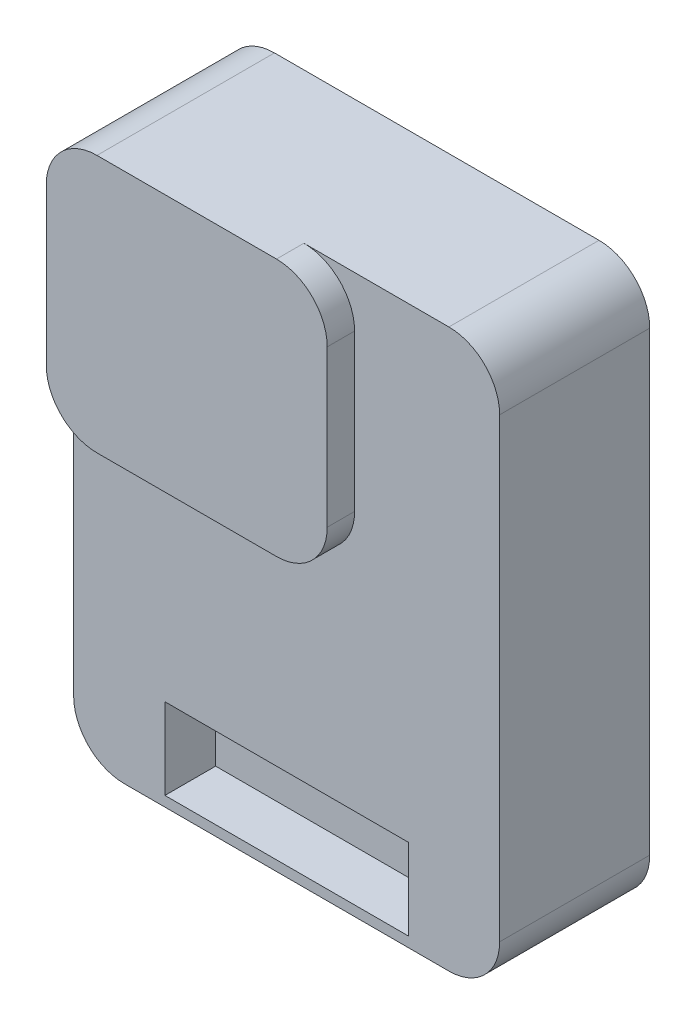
ISO-10303-21;
HEADER;
FILE_DESCRIPTION(('STEP AP214'),'2;1');
FILE_NAME('part.step','',(''),(''),'','','');
FILE_SCHEMA(('AUTOMOTIVE_DESIGN { 1 0 10303 214 1 1 1 1 }'));
ENDSEC;
DATA;
#1=APPLICATION_CONTEXT('core data for automotive mechanical design processes');
#2=APPLICATION_PROTOCOL_DEFINITION('international standard','automotive_design',2000,#1);
#3=PRODUCT_CONTEXT('',#1,'mechanical');
#4=PRODUCT('Part','Part','',(#3));
#5=PRODUCT_RELATED_PRODUCT_CATEGORY('part','',(#4));
#6=PRODUCT_DEFINITION_FORMATION('','',#4);
#7=PRODUCT_DEFINITION_CONTEXT('part definition',#1,'design');
#8=PRODUCT_DEFINITION('design','',#6,#7);
#9=PRODUCT_DEFINITION_SHAPE('','',#8);
#10=(LENGTH_UNIT() NAMED_UNIT(*) SI_UNIT(.MILLI.,.METRE.));
#11=(NAMED_UNIT(*) PLANE_ANGLE_UNIT() SI_UNIT($,.RADIAN.));
#12=(NAMED_UNIT(*) SI_UNIT($,.STERADIAN.) SOLID_ANGLE_UNIT());
#13=UNCERTAINTY_MEASURE_WITH_UNIT(LENGTH_MEASURE(1.E-05),#10,'distance_accuracy_value','');
#14=(GEOMETRIC_REPRESENTATION_CONTEXT(3) GLOBAL_UNCERTAINTY_ASSIGNED_CONTEXT((#13)) GLOBAL_UNIT_ASSIGNED_CONTEXT((#10,
#11,#12)) REPRESENTATION_CONTEXT('',''));
#15=CARTESIAN_POINT('',(0.,0.,0.));
#16=DIRECTION('',(0.,0.,1.));
#17=DIRECTION('',(1.,0.,0.));
#18=AXIS2_PLACEMENT_3D('',#15,#16,#17);
#19=CARTESIAN_POINT('',(0.,0.,14.8));
#20=DIRECTION('',(0.,0.,1.));
#21=DIRECTION('',(1.,0.,0.));
#22=AXIS2_PLACEMENT_3D('',#19,#20,#21);
#23=PLANE('',#22);
#24=DIRECTION('',(0.,1.,0.));
#25=VECTOR('',#24,1.);
#26=CARTESIAN_POINT('',(12.,-18.5,14.8));
#27=LINE('',#26,#25);
#28=CARTESIAN_POINT('',(12.,-26.5,14.8));
#29=VERTEX_POINT('',#28);
#30=CARTESIAN_POINT('',(12.,-18.5,14.8));
#31=VERTEX_POINT('',#30);
#32=EDGE_CURVE('E51',#29,#31,#27,.T.);
#33=ORIENTED_EDGE('',*,*,#32,.F.);
#34=DIRECTION('',(1.,0.,0.));
#35=VECTOR('',#34,1.);
#36=CARTESIAN_POINT('',(-12.,-26.5,14.8));
#37=LINE('',#36,#35);
#38=CARTESIAN_POINT('',(-12.,-26.5,14.8));
#39=VERTEX_POINT('',#38);
#40=EDGE_CURVE('E182',#39,#29,#37,.T.);
#41=ORIENTED_EDGE('',*,*,#40,.F.);
#42=DIRECTION('',(0.,-1.,0.));
#43=VECTOR('',#42,1.);
#44=CARTESIAN_POINT('',(-12.,-18.5,14.8));
#45=LINE('',#44,#43);
#46=CARTESIAN_POINT('',(-12.,-18.5,14.8));
#47=VERTEX_POINT('',#46);
#48=EDGE_CURVE('E185',#47,#39,#45,.T.);
#49=ORIENTED_EDGE('',*,*,#48,.F.);
#50=DIRECTION('',(-1.,0.,0.));
#51=VECTOR('',#50,1.);
#52=CARTESIAN_POINT('',(-12.,-18.5,14.8));
#53=LINE('',#52,#51);
#54=EDGE_CURVE('E191',#31,#47,#53,.T.);
#55=ORIENTED_EDGE('',*,*,#54,.F.);
#56=EDGE_LOOP('',(#33,#41,#49,#55));
#57=FACE_BOUND('',#56,.T.);
#58=DIRECTION('',(0.,1.,0.));
#59=VECTOR('',#58,1.);
#60=CARTESIAN_POINT('',(21.,27.5,14.8));
#61=LINE('',#60,#59);
#62=CARTESIAN_POINT('',(21.,-22.5,14.8));
#63=VERTEX_POINT('',#62);
#64=CARTESIAN_POINT('',(21.,22.5,14.8));
#65=VERTEX_POINT('',#64);
#66=EDGE_CURVE('E219',#63,#65,#61,.T.);
#67=ORIENTED_EDGE('',*,*,#66,.T.);
#68=CARTESIAN_POINT('',(16.,22.5,14.8));
#69=DIRECTION('',(0.,0.,1.));
#70=DIRECTION('',(1.,0.,0.));
#71=AXIS2_PLACEMENT_3D('',#68,#69,#70);
#72=CIRCLE('',#71,5.);
#73=CARTESIAN_POINT('',(16.,27.5,14.8));
#74=VERTEX_POINT('',#73);
#75=EDGE_CURVE('E289',#65,#74,#72,.T.);
#76=ORIENTED_EDGE('',*,*,#75,.T.);
#77=DIRECTION('',(-1.,0.,0.));
#78=VECTOR('',#77,1.);
#79=CARTESIAN_POINT('',(-21.,27.5,14.8));
#80=LINE('',#79,#78);
#81=CARTESIAN_POINT('',(1.69999999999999,27.5,14.8));
#82=VERTEX_POINT('',#81);
#83=EDGE_CURVE('E222',#74,#82,#80,.T.);
#84=ORIENTED_EDGE('',*,*,#83,.T.);
#85=CARTESIAN_POINT('',(1.69999999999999,22.5,14.8));
#86=DIRECTION('',(0.,0.,1.));
#87=DIRECTION('',(1.,0.,0.));
#88=AXIS2_PLACEMENT_3D('',#85,#86,#87);
#89=CIRCLE('',#88,5.);
#90=CARTESIAN_POINT('',(6.69999999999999,22.5,14.8));
#91=VERTEX_POINT('',#90);
#92=EDGE_CURVE('E11',#82,#91,#89,.F.);
#93=ORIENTED_EDGE('',*,*,#92,.T.);
#94=DIRECTION('',(0.,-1.,0.));
#95=VECTOR('',#94,1.);
#96=CARTESIAN_POINT('',(6.7,0.,14.8));
#97=LINE('',#96,#95);
#98=CARTESIAN_POINT('',(6.7,7.10000000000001,14.8));
#99=VERTEX_POINT('',#98);
#100=EDGE_CURVE('E212',#91,#99,#97,.T.);
#101=ORIENTED_EDGE('',*,*,#100,.T.);
#102=CARTESIAN_POINT('',(1.7,7.10000000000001,14.8));
#103=DIRECTION('',(0.,0.,1.));
#104=DIRECTION('',(1.,0.,0.));
#105=AXIS2_PLACEMENT_3D('',#102,#103,#104);
#106=CIRCLE('',#105,5.);
#107=CARTESIAN_POINT('',(1.7,2.1,14.8));
#108=VERTEX_POINT('',#107);
#109=EDGE_CURVE('E44',#99,#108,#106,.F.);
#110=ORIENTED_EDGE('',*,*,#109,.T.);
#111=DIRECTION('',(-1.,0.,0.));
#112=VECTOR('',#111,1.);
#113=CARTESIAN_POINT('',(0.,2.1,14.8));
#114=LINE('',#113,#112);
#115=CARTESIAN_POINT('',(-16.,2.1,14.8));
#116=VERTEX_POINT('',#115);
#117=EDGE_CURVE('E215',#108,#116,#114,.T.);
#118=ORIENTED_EDGE('',*,*,#117,.T.);
#119=CARTESIAN_POINT('',(-16.,7.1,14.8));
#120=DIRECTION('',(0.,0.,1.));
#121=DIRECTION('',(1.,0.,0.));
#122=AXIS2_PLACEMENT_3D('',#119,#120,#121);
#123=CIRCLE('',#122,5.);
#124=CARTESIAN_POINT('',(-21.,7.1,14.8));
#125=VERTEX_POINT('',#124);
#126=EDGE_CURVE('E295',#116,#125,#123,.F.);
#127=ORIENTED_EDGE('',*,*,#126,.T.);
#128=DIRECTION('',(0.,-1.,0.));
#129=VECTOR('',#128,1.);
#130=CARTESIAN_POINT('',(-21.,27.5,14.8));
#131=LINE('',#130,#129);
#132=CARTESIAN_POINT('',(-21.,-22.5,14.8));
#133=VERTEX_POINT('',#132);
#134=EDGE_CURVE('E225',#125,#133,#131,.T.);
#135=ORIENTED_EDGE('',*,*,#134,.T.);
#136=CARTESIAN_POINT('',(-16.,-22.5,14.8));
#137=DIRECTION('',(0.,0.,1.));
#138=DIRECTION('',(1.,0.,0.));
#139=AXIS2_PLACEMENT_3D('',#136,#137,#138);
#140=CIRCLE('',#139,5.);
#141=CARTESIAN_POINT('',(-16.,-27.5,14.8));
#142=VERTEX_POINT('',#141);
#143=EDGE_CURVE('E285',#133,#142,#140,.T.);
#144=ORIENTED_EDGE('',*,*,#143,.T.);
#145=DIRECTION('',(1.,0.,0.));
#146=VECTOR('',#145,1.);
#147=CARTESIAN_POINT('',(-21.,-27.5,14.8));
#148=LINE('',#147,#146);
#149=CARTESIAN_POINT('',(16.,-27.5,14.8));
#150=VERTEX_POINT('',#149);
#151=EDGE_CURVE('E228',#142,#150,#148,.T.);
#152=ORIENTED_EDGE('',*,*,#151,.T.);
#153=CARTESIAN_POINT('',(16.,-22.5,14.8));
#154=DIRECTION('',(0.,0.,1.));
#155=DIRECTION('',(1.,0.,0.));
#156=AXIS2_PLACEMENT_3D('',#153,#154,#155);
#157=CIRCLE('',#156,5.);
#158=EDGE_CURVE('E287',#150,#63,#157,.T.);
#159=ORIENTED_EDGE('',*,*,#158,.T.);
#160=EDGE_LOOP('',(#67,#76,#84,#93,#101,#110,#118,#127,#135,#144,#152,#159));
#161=FACE_BOUND('',#160,.T.);
#162=ADVANCED_FACE('F36',(#57,#161),#23,.T.);
#163=CARTESIAN_POINT('',(21.,27.5,14.8));
#164=DIRECTION('',(-1.,0.,0.));
#165=DIRECTION('',(0.,-1.,0.));
#166=AXIS2_PLACEMENT_3D('',#163,#164,#165);
#167=PLANE('',#166);
#168=DIRECTION('',(0.,1.,0.));
#169=VECTOR('',#168,1.);
#170=CARTESIAN_POINT('',(21.,27.5,0.));
#171=LINE('',#170,#169);
#172=CARTESIAN_POINT('',(21.,-22.5,0.));
#173=VERTEX_POINT('',#172);
#174=CARTESIAN_POINT('',(21.,22.5,0.));
#175=VERTEX_POINT('',#174);
#176=EDGE_CURVE('E218',#173,#175,#171,.T.);
#177=ORIENTED_EDGE('',*,*,#176,.T.);
#178=DIRECTION('',(0.,0.,-1.));
#179=VECTOR('',#178,1.);
#180=CARTESIAN_POINT('',(21.,22.5,14.8));
#181=LINE('',#180,#179);
#182=EDGE_CURVE('E283',#175,#65,#181,.F.);
#183=ORIENTED_EDGE('',*,*,#182,.T.);
#184=ORIENTED_EDGE('',*,*,#66,.F.);
#185=DIRECTION('',(0.,0.,-1.));
#186=VECTOR('',#185,1.);
#187=CARTESIAN_POINT('',(21.,-22.5,14.8));
#188=LINE('',#187,#186);
#189=EDGE_CURVE('E280',#63,#173,#188,.T.);
#190=ORIENTED_EDGE('',*,*,#189,.T.);
#191=EDGE_LOOP('',(#177,#183,#184,#190));
#192=FACE_BOUND('',#191,.T.);
#193=ADVANCED_FACE('F353',(#192),#167,.F.);
#194=CARTESIAN_POINT('',(-21.,27.5,14.8));
#195=DIRECTION('',(0.,-1.,0.));
#196=DIRECTION('',(0.,0.,-1.));
#197=AXIS2_PLACEMENT_3D('',#194,#195,#196);
#198=PLANE('',#197);
#199=DIRECTION('',(-1.,0.,0.));
#200=VECTOR('',#199,1.);
#201=CARTESIAN_POINT('',(-21.,27.5,17.5));
#202=LINE('',#201,#200);
#203=CARTESIAN_POINT('',(1.69999999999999,27.5,17.5));
#204=VERTEX_POINT('',#203);
#205=CARTESIAN_POINT('',(-16.,27.5,17.5));
#206=VERTEX_POINT('',#205);
#207=EDGE_CURVE('E209',#204,#206,#202,.T.);
#208=ORIENTED_EDGE('',*,*,#207,.F.);
#209=DIRECTION('',(0.,0.,-1.));
#210=VECTOR('',#209,1.);
#211=CARTESIAN_POINT('',(1.69999999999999,27.5,14.8));
#212=LINE('',#211,#210);
#213=EDGE_CURVE('E269',#204,#82,#212,.T.);
#214=ORIENTED_EDGE('',*,*,#213,.T.);
#215=ORIENTED_EDGE('',*,*,#83,.F.);
#216=DIRECTION('',(0.,0.,-1.));
#217=VECTOR('',#216,1.);
#218=CARTESIAN_POINT('',(16.,27.5,14.8));
#219=LINE('',#218,#217);
#220=CARTESIAN_POINT('',(16.,27.5,0.));
#221=VERTEX_POINT('',#220);
#222=EDGE_CURVE('E266',#74,#221,#219,.T.);
#223=ORIENTED_EDGE('',*,*,#222,.T.);
#224=DIRECTION('',(-1.,0.,0.));
#225=VECTOR('',#224,1.);
#226=CARTESIAN_POINT('',(-21.,27.5,0.));
#227=LINE('',#226,#225);
#228=CARTESIAN_POINT('',(-16.,27.5,0.));
#229=VERTEX_POINT('',#228);
#230=EDGE_CURVE('E233',#221,#229,#227,.T.);
#231=ORIENTED_EDGE('',*,*,#230,.T.);
#232=DIRECTION('',(0.,0.,-1.));
#233=VECTOR('',#232,1.);
#234=CARTESIAN_POINT('',(-16.,27.5,14.8));
#235=LINE('',#234,#233);
#236=EDGE_CURVE('E264',#229,#206,#235,.F.);
#237=ORIENTED_EDGE('',*,*,#236,.T.);
#238=EDGE_LOOP('',(#208,#214,#215,#223,#231,#237));
#239=FACE_BOUND('',#238,.T.);
#240=ADVANCED_FACE('F323',(#239),#198,.F.);
#241=CARTESIAN_POINT('',(-21.,27.5,14.8));
#242=DIRECTION('',(1.,0.,0.));
#243=DIRECTION('',(0.,1.,0.));
#244=AXIS2_PLACEMENT_3D('',#241,#242,#243);
#245=PLANE('',#244);
#246=ORIENTED_EDGE('',*,*,#134,.F.);
#247=DIRECTION('',(0.,0.,-1.));
#248=VECTOR('',#247,1.);
#249=CARTESIAN_POINT('',(-21.,7.1,14.8));
#250=LINE('',#249,#248);
#251=CARTESIAN_POINT('',(-21.,7.1,17.5));
#252=VERTEX_POINT('',#251);
#253=EDGE_CURVE('E249',#125,#252,#250,.F.);
#254=ORIENTED_EDGE('',*,*,#253,.T.);
#255=DIRECTION('',(0.,-1.,0.));
#256=VECTOR('',#255,1.);
#257=CARTESIAN_POINT('',(-21.,27.5,17.5));
#258=LINE('',#257,#256);
#259=CARTESIAN_POINT('',(-21.,22.5,17.5));
#260=VERTEX_POINT('',#259);
#261=EDGE_CURVE('E197',#260,#252,#258,.T.);
#262=ORIENTED_EDGE('',*,*,#261,.F.);
#263=DIRECTION('',(0.,0.,-1.));
#264=VECTOR('',#263,1.);
#265=CARTESIAN_POINT('',(-21.,22.5,14.8));
#266=LINE('',#265,#264);
#267=CARTESIAN_POINT('',(-21.,22.5,0.));
#268=VERTEX_POINT('',#267);
#269=EDGE_CURVE('E244',#260,#268,#266,.T.);
#270=ORIENTED_EDGE('',*,*,#269,.T.);
#271=DIRECTION('',(0.,-1.,0.));
#272=VECTOR('',#271,1.);
#273=CARTESIAN_POINT('',(-21.,27.5,0.));
#274=LINE('',#273,#272);
#275=CARTESIAN_POINT('',(-21.,-22.5,0.));
#276=VERTEX_POINT('',#275);
#277=EDGE_CURVE('E236',#268,#276,#274,.T.);
#278=ORIENTED_EDGE('',*,*,#277,.T.);
#279=DIRECTION('',(0.,0.,-1.));
#280=VECTOR('',#279,1.);
#281=CARTESIAN_POINT('',(-21.,-22.5,14.8));
#282=LINE('',#281,#280);
#283=EDGE_CURVE('E247',#276,#133,#282,.F.);
#284=ORIENTED_EDGE('',*,*,#283,.T.);
#285=EDGE_LOOP('',(#246,#254,#262,#270,#278,#284));
#286=FACE_BOUND('',#285,.T.);
#287=ADVANCED_FACE('F332',(#286),#245,.F.);
#288=CARTESIAN_POINT('',(-21.,-27.5,14.8));
#289=DIRECTION('',(0.,1.,0.));
#290=DIRECTION('',(0.,0.,1.));
#291=AXIS2_PLACEMENT_3D('',#288,#289,#290);
#292=PLANE('',#291);
#293=DIRECTION('',(1.,0.,0.));
#294=VECTOR('',#293,1.);
#295=CARTESIAN_POINT('',(-21.,-27.5,0.));
#296=LINE('',#295,#294);
#297=CARTESIAN_POINT('',(-16.,-27.5,0.));
#298=VERTEX_POINT('',#297);
#299=CARTESIAN_POINT('',(16.,-27.5,0.));
#300=VERTEX_POINT('',#299);
#301=EDGE_CURVE('E223',#298,#300,#296,.T.);
#302=ORIENTED_EDGE('',*,*,#301,.T.);
#303=DIRECTION('',(0.,0.,-1.));
#304=VECTOR('',#303,1.);
#305=CARTESIAN_POINT('',(16.,-27.5,14.8));
#306=LINE('',#305,#304);
#307=EDGE_CURVE('E59',#300,#150,#306,.F.);
#308=ORIENTED_EDGE('',*,*,#307,.T.);
#309=ORIENTED_EDGE('',*,*,#151,.F.);
#310=DIRECTION('',(0.,0.,-1.));
#311=VECTOR('',#310,1.);
#312=CARTESIAN_POINT('',(-16.,-27.5,14.8));
#313=LINE('',#312,#311);
#314=EDGE_CURVE('E291',#142,#298,#313,.T.);
#315=ORIENTED_EDGE('',*,*,#314,.T.);
#316=EDGE_LOOP('',(#302,#308,#309,#315));
#317=FACE_BOUND('',#316,.T.);
#318=ADVANCED_FACE('F343',(#317),#292,.F.);
#319=CARTESIAN_POINT('',(0.,0.,0.));
#320=DIRECTION('',(0.,0.,1.));
#321=DIRECTION('',(1.,0.,0.));
#322=AXIS2_PLACEMENT_3D('',#319,#320,#321);
#323=PLANE('',#322);
#324=ORIENTED_EDGE('',*,*,#230,.F.);
#325=CARTESIAN_POINT('',(16.,22.5,0.));
#326=DIRECTION('',(0.,0.,1.));
#327=DIRECTION('',(1.,0.,0.));
#328=AXIS2_PLACEMENT_3D('',#325,#326,#327);
#329=CIRCLE('',#328,5.);
#330=EDGE_CURVE('E278',#221,#175,#329,.F.);
#331=ORIENTED_EDGE('',*,*,#330,.T.);
#332=ORIENTED_EDGE('',*,*,#176,.F.);
#333=CARTESIAN_POINT('',(16.,-22.5,0.));
#334=DIRECTION('',(0.,0.,1.));
#335=DIRECTION('',(1.,0.,0.));
#336=AXIS2_PLACEMENT_3D('',#333,#334,#335);
#337=CIRCLE('',#336,5.);
#338=EDGE_CURVE('E276',#173,#300,#337,.F.);
#339=ORIENTED_EDGE('',*,*,#338,.T.);
#340=ORIENTED_EDGE('',*,*,#301,.F.);
#341=CARTESIAN_POINT('',(-16.,-22.5,0.));
#342=DIRECTION('',(0.,0.,1.));
#343=DIRECTION('',(1.,0.,0.));
#344=AXIS2_PLACEMENT_3D('',#341,#342,#343);
#345=CIRCLE('',#344,5.);
#346=EDGE_CURVE('E274',#298,#276,#345,.F.);
#347=ORIENTED_EDGE('',*,*,#346,.T.);
#348=ORIENTED_EDGE('',*,*,#277,.F.);
#349=CARTESIAN_POINT('',(-16.,22.5,0.));
#350=DIRECTION('',(0.,0.,1.));
#351=DIRECTION('',(1.,0.,0.));
#352=AXIS2_PLACEMENT_3D('',#349,#350,#351);
#353=CIRCLE('',#352,5.);
#354=EDGE_CURVE('E272',#268,#229,#353,.F.);
#355=ORIENTED_EDGE('',*,*,#354,.T.);
#356=EDGE_LOOP('',(#324,#331,#332,#339,#340,#347,#348,#355));
#357=FACE_BOUND('',#356,.T.);
#358=ADVANCED_FACE('F345',(#357),#323,.F.);
#359=CARTESIAN_POINT('',(-21.,2.1,17.5));
#360=DIRECTION('',(0.,1.,0.));
#361=DIRECTION('',(0.,0.,1.));
#362=AXIS2_PLACEMENT_3D('',#359,#360,#361);
#363=PLANE('',#362);
#364=DIRECTION('',(1.,0.,0.));
#365=VECTOR('',#364,1.);
#366=CARTESIAN_POINT('',(-21.,2.1,17.5));
#367=LINE('',#366,#365);
#368=CARTESIAN_POINT('',(-16.,2.1,17.5));
#369=VERTEX_POINT('',#368);
#370=CARTESIAN_POINT('',(1.69999999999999,2.1,17.5));
#371=VERTEX_POINT('',#370);
#372=EDGE_CURVE('E203',#369,#371,#367,.T.);
#373=ORIENTED_EDGE('',*,*,#372,.F.);
#374=DIRECTION('',(0.,0.,-1.));
#375=VECTOR('',#374,1.);
#376=CARTESIAN_POINT('',(-16.,2.1,17.5));
#377=LINE('',#376,#375);
#378=EDGE_CURVE('E241',#369,#116,#377,.T.);
#379=ORIENTED_EDGE('',*,*,#378,.T.);
#380=ORIENTED_EDGE('',*,*,#117,.F.);
#381=DIRECTION('',(0.,0.,-1.));
#382=VECTOR('',#381,1.);
#383=CARTESIAN_POINT('',(1.7,2.1,17.5));
#384=LINE('',#383,#382);
#385=EDGE_CURVE('E230',#108,#371,#384,.F.);
#386=ORIENTED_EDGE('',*,*,#385,.T.);
#387=EDGE_LOOP('',(#373,#379,#380,#386));
#388=FACE_BOUND('',#387,.T.);
#389=ADVANCED_FACE('F305',(#388),#363,.F.);
#390=CARTESIAN_POINT('',(6.69999999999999,27.5,17.5));
#391=DIRECTION('',(-1.,0.,0.));
#392=DIRECTION('',(0.,-1.,0.));
#393=AXIS2_PLACEMENT_3D('',#390,#391,#392);
#394=PLANE('',#393);
#395=DIRECTION('',(0.,1.,0.));
#396=VECTOR('',#395,1.);
#397=CARTESIAN_POINT('',(6.69999999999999,27.5,17.5));
#398=LINE('',#397,#396);
#399=CARTESIAN_POINT('',(6.7,7.10000000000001,17.5));
#400=VERTEX_POINT('',#399);
#401=CARTESIAN_POINT('',(6.69999999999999,22.5,17.5));
#402=VERTEX_POINT('',#401);
#403=EDGE_CURVE('E206',#400,#402,#398,.T.);
#404=ORIENTED_EDGE('',*,*,#403,.F.);
#405=DIRECTION('',(0.,0.,-1.));
#406=VECTOR('',#405,1.);
#407=CARTESIAN_POINT('',(6.7,7.10000000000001,17.5));
#408=LINE('',#407,#406);
#409=EDGE_CURVE('E261',#400,#99,#408,.T.);
#410=ORIENTED_EDGE('',*,*,#409,.T.);
#411=ORIENTED_EDGE('',*,*,#100,.F.);
#412=DIRECTION('',(0.,0.,-1.));
#413=VECTOR('',#412,1.);
#414=CARTESIAN_POINT('',(6.69999999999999,22.5,17.5));
#415=LINE('',#414,#413);
#416=EDGE_CURVE('E259',#91,#402,#415,.F.);
#417=ORIENTED_EDGE('',*,*,#416,.T.);
#418=EDGE_LOOP('',(#404,#410,#411,#417));
#419=FACE_BOUND('',#418,.T.);
#420=ADVANCED_FACE('F314',(#419),#394,.F.);
#421=CARTESIAN_POINT('',(0.,0.,17.5));
#422=DIRECTION('',(0.,0.,1.));
#423=DIRECTION('',(1.,0.,0.));
#424=AXIS2_PLACEMENT_3D('',#421,#422,#423);
#425=PLANE('',#424);
#426=ORIENTED_EDGE('',*,*,#261,.T.);
#427=CARTESIAN_POINT('',(-16.,7.1,17.5));
#428=DIRECTION('',(0.,0.,1.));
#429=DIRECTION('',(1.,0.,0.));
#430=AXIS2_PLACEMENT_3D('',#427,#428,#429);
#431=CIRCLE('',#430,5.);
#432=EDGE_CURVE('E257',#252,#369,#431,.T.);
#433=ORIENTED_EDGE('',*,*,#432,.T.);
#434=ORIENTED_EDGE('',*,*,#372,.T.);
#435=CARTESIAN_POINT('',(1.7,7.10000000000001,17.5));
#436=DIRECTION('',(0.,0.,1.));
#437=DIRECTION('',(1.,0.,0.));
#438=AXIS2_PLACEMENT_3D('',#435,#436,#437);
#439=CIRCLE('',#438,5.);
#440=EDGE_CURVE('E255',#371,#400,#439,.T.);
#441=ORIENTED_EDGE('',*,*,#440,.T.);
#442=ORIENTED_EDGE('',*,*,#403,.T.);
#443=CARTESIAN_POINT('',(1.69999999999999,22.5,17.5));
#444=DIRECTION('',(0.,0.,1.));
#445=DIRECTION('',(1.,0.,0.));
#446=AXIS2_PLACEMENT_3D('',#443,#444,#445);
#447=CIRCLE('',#446,5.);
#448=EDGE_CURVE('E253',#402,#204,#447,.T.);
#449=ORIENTED_EDGE('',*,*,#448,.T.);
#450=ORIENTED_EDGE('',*,*,#207,.T.);
#451=CARTESIAN_POINT('',(-16.,22.5,17.5));
#452=DIRECTION('',(0.,0.,1.));
#453=DIRECTION('',(1.,0.,0.));
#454=AXIS2_PLACEMENT_3D('',#451,#452,#453);
#455=CIRCLE('',#454,5.);
#456=EDGE_CURVE('E251',#206,#260,#455,.T.);
#457=ORIENTED_EDGE('',*,*,#456,.T.);
#458=EDGE_LOOP('',(#426,#433,#434,#441,#442,#449,#450,#457));
#459=FACE_BOUND('',#458,.T.);
#460=ADVANCED_FACE('F311',(#459),#425,.T.);
#461=CARTESIAN_POINT('',(-16.,7.1,17.5));
#462=DIRECTION('',(0.,0.,-1.));
#463=DIRECTION('',(-1.,0.,0.));
#464=AXIS2_PLACEMENT_3D('',#461,#462,#463);
#465=CYLINDRICAL_SURFACE('',#464,5.);
#466=ORIENTED_EDGE('',*,*,#432,.F.);
#467=ORIENTED_EDGE('',*,*,#253,.F.);
#468=ORIENTED_EDGE('',*,*,#126,.F.);
#469=ORIENTED_EDGE('',*,*,#378,.F.);
#470=EDGE_LOOP('',(#466,#467,#468,#469));
#471=FACE_BOUND('',#470,.T.);
#472=ADVANCED_FACE('F336',(#471),#465,.T.);
#473=CARTESIAN_POINT('',(1.7,7.10000000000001,17.5));
#474=DIRECTION('',(0.,0.,-1.));
#475=DIRECTION('',(-1.,0.,0.));
#476=AXIS2_PLACEMENT_3D('',#473,#474,#475);
#477=CYLINDRICAL_SURFACE('',#476,5.);
#478=ORIENTED_EDGE('',*,*,#440,.F.);
#479=ORIENTED_EDGE('',*,*,#385,.F.);
#480=ORIENTED_EDGE('',*,*,#109,.F.);
#481=ORIENTED_EDGE('',*,*,#409,.F.);
#482=EDGE_LOOP('',(#478,#479,#480,#481));
#483=FACE_BOUND('',#482,.T.);
#484=ADVANCED_FACE('F308',(#483),#477,.T.);
#485=CARTESIAN_POINT('',(1.69999999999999,22.5,14.8));
#486=DIRECTION('',(0.,0.,-1.));
#487=DIRECTION('',(-1.,0.,0.));
#488=AXIS2_PLACEMENT_3D('',#485,#486,#487);
#489=CYLINDRICAL_SURFACE('',#488,5.);
#490=ORIENTED_EDGE('',*,*,#448,.F.);
#491=ORIENTED_EDGE('',*,*,#416,.F.);
#492=ORIENTED_EDGE('',*,*,#92,.F.);
#493=ORIENTED_EDGE('',*,*,#213,.F.);
#494=EDGE_LOOP('',(#490,#491,#492,#493));
#495=FACE_BOUND('',#494,.T.);
#496=ADVANCED_FACE('F318',(#495),#489,.T.);
#497=CARTESIAN_POINT('',(16.,22.5,14.8));
#498=DIRECTION('',(0.,0.,-1.));
#499=DIRECTION('',(-1.,0.,0.));
#500=AXIS2_PLACEMENT_3D('',#497,#498,#499);
#501=CYLINDRICAL_SURFACE('',#500,5.);
#502=ORIENTED_EDGE('',*,*,#75,.F.);
#503=ORIENTED_EDGE('',*,*,#182,.F.);
#504=ORIENTED_EDGE('',*,*,#330,.F.);
#505=ORIENTED_EDGE('',*,*,#222,.F.);
#506=EDGE_LOOP('',(#502,#503,#504,#505));
#507=FACE_BOUND('',#506,.T.);
#508=ADVANCED_FACE('F358',(#507),#501,.T.);
#509=CARTESIAN_POINT('',(16.,-22.5,14.8));
#510=DIRECTION('',(0.,0.,-1.));
#511=DIRECTION('',(-1.,0.,0.));
#512=AXIS2_PLACEMENT_3D('',#509,#510,#511);
#513=CYLINDRICAL_SURFACE('',#512,5.);
#514=ORIENTED_EDGE('',*,*,#158,.F.);
#515=ORIENTED_EDGE('',*,*,#307,.F.);
#516=ORIENTED_EDGE('',*,*,#338,.F.);
#517=ORIENTED_EDGE('',*,*,#189,.F.);
#518=EDGE_LOOP('',(#514,#515,#516,#517));
#519=FACE_BOUND('',#518,.T.);
#520=ADVANCED_FACE('F350',(#519),#513,.T.);
#521=CARTESIAN_POINT('',(-16.,-22.5,14.8));
#522=DIRECTION('',(0.,0.,-1.));
#523=DIRECTION('',(-1.,0.,0.));
#524=AXIS2_PLACEMENT_3D('',#521,#522,#523);
#525=CYLINDRICAL_SURFACE('',#524,5.);
#526=ORIENTED_EDGE('',*,*,#143,.F.);
#527=ORIENTED_EDGE('',*,*,#283,.F.);
#528=ORIENTED_EDGE('',*,*,#346,.F.);
#529=ORIENTED_EDGE('',*,*,#314,.F.);
#530=EDGE_LOOP('',(#526,#527,#528,#529));
#531=FACE_BOUND('',#530,.T.);
#532=ADVANCED_FACE('F341',(#531),#525,.T.);
#533=CARTESIAN_POINT('',(-16.,22.5,14.8));
#534=DIRECTION('',(0.,0.,-1.));
#535=DIRECTION('',(-1.,0.,0.));
#536=AXIS2_PLACEMENT_3D('',#533,#534,#535);
#537=CYLINDRICAL_SURFACE('',#536,5.);
#538=ORIENTED_EDGE('',*,*,#456,.F.);
#539=ORIENTED_EDGE('',*,*,#236,.F.);
#540=ORIENTED_EDGE('',*,*,#354,.F.);
#541=ORIENTED_EDGE('',*,*,#269,.F.);
#542=EDGE_LOOP('',(#538,#539,#540,#541));
#543=FACE_BOUND('',#542,.T.);
#544=ADVANCED_FACE('F38',(#543),#537,.T.);
#545=CARTESIAN_POINT('',(12.,-18.5,9.8));
#546=DIRECTION('',(1.,0.,0.));
#547=DIRECTION('',(0.,0.,-1.));
#548=AXIS2_PLACEMENT_3D('',#545,#546,#547);
#549=PLANE('',#548);
#550=ORIENTED_EDGE('',*,*,#32,.T.);
#551=DIRECTION('',(0.,0.,1.));
#552=VECTOR('',#551,1.);
#553=CARTESIAN_POINT('',(12.,-18.5,9.8));
#554=LINE('',#553,#552);
#555=CARTESIAN_POINT('',(12.,-18.5,9.8));
#556=VERTEX_POINT('',#555);
#557=EDGE_CURVE('E160',#556,#31,#554,.T.);
#558=ORIENTED_EDGE('',*,*,#557,.F.);
#559=DIRECTION('',(0.,1.,0.));
#560=VECTOR('',#559,1.);
#561=CARTESIAN_POINT('',(12.,-18.5,9.8));
#562=LINE('',#561,#560);
#563=CARTESIAN_POINT('',(12.,-26.5,9.8));
#564=VERTEX_POINT('',#563);
#565=EDGE_CURVE('E164',#564,#556,#562,.T.);
#566=ORIENTED_EDGE('',*,*,#565,.F.);
#567=DIRECTION('',(0.,0.,1.));
#568=VECTOR('',#567,1.);
#569=CARTESIAN_POINT('',(12.,-26.5,9.8));
#570=LINE('',#569,#568);
#571=EDGE_CURVE('E195',#564,#29,#570,.T.);
#572=ORIENTED_EDGE('',*,*,#571,.T.);
#573=EDGE_LOOP('',(#550,#558,#566,#572));
#574=FACE_BOUND('',#573,.T.);
#575=ADVANCED_FACE('F162',(#574),#549,.F.);
#576=CARTESIAN_POINT('',(-12.,-26.5,9.8));
#577=DIRECTION('',(0.,-1.,0.));
#578=DIRECTION('',(0.,0.,-1.));
#579=AXIS2_PLACEMENT_3D('',#576,#577,#578);
#580=PLANE('',#579);
#581=ORIENTED_EDGE('',*,*,#40,.T.);
#582=ORIENTED_EDGE('',*,*,#571,.F.);
#583=DIRECTION('',(1.,0.,0.));
#584=VECTOR('',#583,1.);
#585=CARTESIAN_POINT('',(-12.,-26.5,9.8));
#586=LINE('',#585,#584);
#587=CARTESIAN_POINT('',(-12.,-26.5,9.8));
#588=VERTEX_POINT('',#587);
#589=EDGE_CURVE('E170',#588,#564,#586,.T.);
#590=ORIENTED_EDGE('',*,*,#589,.F.);
#591=DIRECTION('',(0.,0.,1.));
#592=VECTOR('',#591,1.);
#593=CARTESIAN_POINT('',(-12.,-26.5,9.8));
#594=LINE('',#593,#592);
#595=EDGE_CURVE('E198',#588,#39,#594,.T.);
#596=ORIENTED_EDGE('',*,*,#595,.T.);
#597=EDGE_LOOP('',(#581,#582,#590,#596));
#598=FACE_BOUND('',#597,.T.);
#599=ADVANCED_FACE('F436',(#598),#580,.F.);
#600=CARTESIAN_POINT('',(-12.,-18.5,9.8));
#601=DIRECTION('',(-1.,0.,0.));
#602=DIRECTION('',(0.,-1.,0.));
#603=AXIS2_PLACEMENT_3D('',#600,#601,#602);
#604=PLANE('',#603);
#605=ORIENTED_EDGE('',*,*,#48,.T.);
#606=ORIENTED_EDGE('',*,*,#595,.F.);
#607=DIRECTION('',(0.,-1.,0.));
#608=VECTOR('',#607,1.);
#609=CARTESIAN_POINT('',(-12.,-18.5,9.8));
#610=LINE('',#609,#608);
#611=CARTESIAN_POINT('',(-12.,-18.5,9.8));
#612=VERTEX_POINT('',#611);
#613=EDGE_CURVE('E178',#612,#588,#610,.T.);
#614=ORIENTED_EDGE('',*,*,#613,.F.);
#615=DIRECTION('',(0.,0.,1.));
#616=VECTOR('',#615,1.);
#617=CARTESIAN_POINT('',(-12.,-18.5,9.8));
#618=LINE('',#617,#616);
#619=EDGE_CURVE('E169',#612,#47,#618,.T.);
#620=ORIENTED_EDGE('',*,*,#619,.T.);
#621=EDGE_LOOP('',(#605,#606,#614,#620));
#622=FACE_BOUND('',#621,.T.);
#623=ADVANCED_FACE('F445',(#622),#604,.F.);
#624=CARTESIAN_POINT('',(-12.,-18.5,9.8));
#625=DIRECTION('',(0.,1.,0.));
#626=DIRECTION('',(0.,0.,1.));
#627=AXIS2_PLACEMENT_3D('',#624,#625,#626);
#628=PLANE('',#627);
#629=ORIENTED_EDGE('',*,*,#54,.T.);
#630=ORIENTED_EDGE('',*,*,#619,.F.);
#631=DIRECTION('',(-1.,0.,0.));
#632=VECTOR('',#631,1.);
#633=CARTESIAN_POINT('',(-12.,-18.5,9.8));
#634=LINE('',#633,#632);
#635=EDGE_CURVE('E173',#556,#612,#634,.T.);
#636=ORIENTED_EDGE('',*,*,#635,.F.);
#637=ORIENTED_EDGE('',*,*,#557,.T.);
#638=EDGE_LOOP('',(#629,#630,#636,#637));
#639=FACE_BOUND('',#638,.T.);
#640=ADVANCED_FACE('F174',(#639),#628,.F.);
#641=CARTESIAN_POINT('',(0.,0.,9.8));
#642=DIRECTION('',(0.,0.,1.));
#643=DIRECTION('',(1.,0.,0.));
#644=AXIS2_PLACEMENT_3D('',#641,#642,#643);
#645=PLANE('',#644);
#646=ORIENTED_EDGE('',*,*,#565,.T.);
#647=ORIENTED_EDGE('',*,*,#635,.T.);
#648=ORIENTED_EDGE('',*,*,#613,.T.);
#649=ORIENTED_EDGE('',*,*,#589,.T.);
#650=EDGE_LOOP('',(#646,#647,#648,#649));
#651=FACE_BOUND('',#650,.T.);
#652=ADVANCED_FACE('F180',(#651),#645,.T.);
#653=CLOSED_SHELL('',(#162,#193,#240,#287,#318,#358,#389,#420,#460,#472,#484,#496,#508,#520,
#532,#544,#575,#599,#623,#640,#652));
#654=MANIFOLD_SOLID_BREP('B2',#653);
#655=ADVANCED_BREP_SHAPE_REPRESENTATION('',(#18,#654),#14);
#656=SHAPE_DEFINITION_REPRESENTATION(#9,#655);
ENDSEC;
END-ISO-10303-21;
